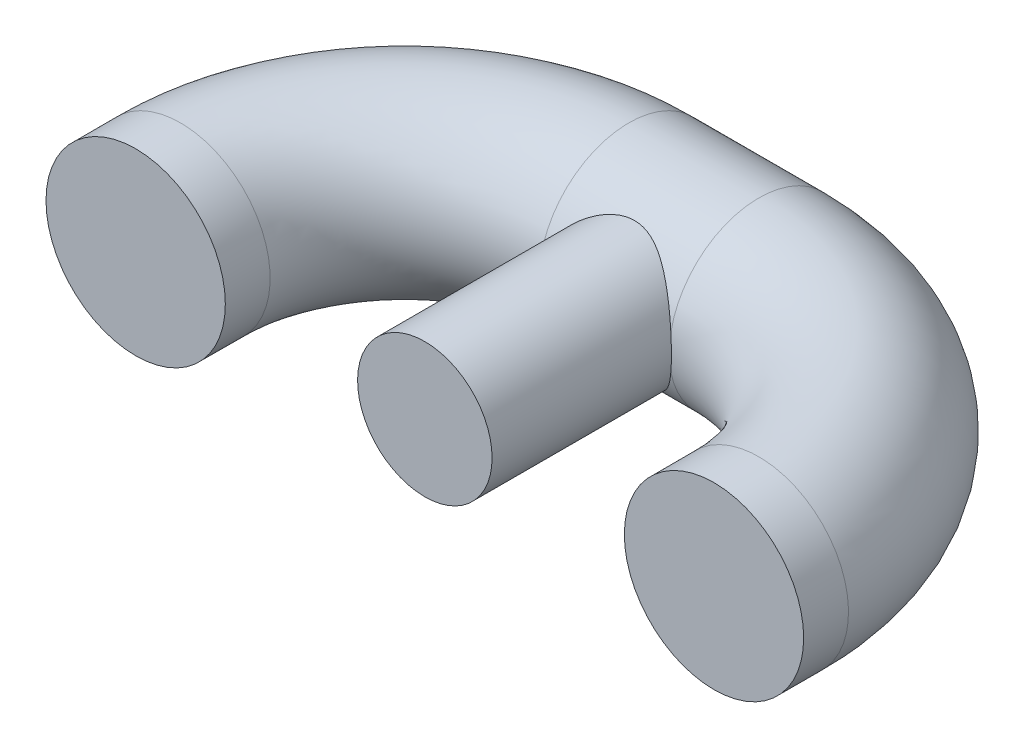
ISO-10303-21;
HEADER;
FILE_DESCRIPTION(('STEP AP214'),'2;1');
FILE_NAME('part.step','',(''),(''),'','','');
FILE_SCHEMA(('AUTOMOTIVE_DESIGN { 1 0 10303 214 1 1 1 1 }'));
ENDSEC;
DATA;
#1=APPLICATION_CONTEXT('core data for automotive mechanical design processes');
#2=APPLICATION_PROTOCOL_DEFINITION('international standard','automotive_design',2000,#1);
#3=PRODUCT_CONTEXT('',#1,'mechanical');
#4=PRODUCT('Part','Part','',(#3));
#5=PRODUCT_RELATED_PRODUCT_CATEGORY('part','',(#4));
#6=PRODUCT_DEFINITION_FORMATION('','',#4);
#7=PRODUCT_DEFINITION_CONTEXT('part definition',#1,'design');
#8=PRODUCT_DEFINITION('design','',#6,#7);
#9=PRODUCT_DEFINITION_SHAPE('','',#8);
#10=(LENGTH_UNIT() NAMED_UNIT(*) SI_UNIT(.MILLI.,.METRE.));
#11=(NAMED_UNIT(*) PLANE_ANGLE_UNIT() SI_UNIT($,.RADIAN.));
#12=(NAMED_UNIT(*) SI_UNIT($,.STERADIAN.) SOLID_ANGLE_UNIT());
#13=UNCERTAINTY_MEASURE_WITH_UNIT(LENGTH_MEASURE(1.E-05),#10,'distance_accuracy_value','');
#14=(GEOMETRIC_REPRESENTATION_CONTEXT(3) GLOBAL_UNCERTAINTY_ASSIGNED_CONTEXT((#13)) GLOBAL_UNIT_ASSIGNED_CONTEXT((#10,
#11,#12)) REPRESENTATION_CONTEXT('',''));
#15=CARTESIAN_POINT('',(0.,0.,0.));
#16=DIRECTION('',(0.,0.,1.));
#17=DIRECTION('',(1.,0.,0.));
#18=AXIS2_PLACEMENT_3D('',#15,#16,#17);
#19=CARTESIAN_POINT('',(0.,0.,0.254));
#20=DIRECTION('',(0.,0.,-1.));
#21=DIRECTION('',(-1.,0.,0.));
#22=AXIS2_PLACEMENT_3D('',#19,#20,#21);
#23=CYLINDRICAL_SURFACE('',#22,0.381);
#24=CARTESIAN_POINT('',(0.,0.,0.254));
#25=DIRECTION('',(0.,0.,1.));
#26=DIRECTION('',(1.,0.,0.));
#27=AXIS2_PLACEMENT_3D('',#24,#25,#26);
#28=CIRCLE('',#27,0.381);
#29=CARTESIAN_POINT('',(0.381,0.,0.254));
#30=VERTEX_POINT('',#29);
#31=EDGE_CURVE('E75',#30,#30,#28,.T.);
#32=ORIENTED_EDGE('',*,*,#31,.F.);
#33=EDGE_LOOP('',(#32));
#34=FACE_BOUND('',#33,.T.);
#35=CARTESIAN_POINT('',(0.368099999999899,0.0983025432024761,-0.771601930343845));
#36=CARTESIAN_POINT('',(0.372626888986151,0.0814541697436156,-0.768241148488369));
#37=CARTESIAN_POINT('',(0.375991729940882,0.0641084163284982,-0.765707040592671));
#38=CARTESIAN_POINT('',(0.380245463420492,0.02943201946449,-0.762481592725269));
#39=CARTESIAN_POINT('',(0.381198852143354,0.01211365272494,-0.761742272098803));
#40=CARTESIAN_POINT('',(0.380753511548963,-0.0207896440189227,-0.762082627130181));
#41=CARTESIAN_POINT('',(0.379573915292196,-0.036379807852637,-0.762992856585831));
#42=CARTESIAN_POINT('',(0.375305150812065,-0.0675522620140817,-0.766227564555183));
#43=CARTESIAN_POINT('',(0.372168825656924,-0.0831245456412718,-0.768586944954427));
#44=CARTESIAN_POINT('',(0.368100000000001,-0.0983025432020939,-0.77160193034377));
#45=B_SPLINE_CURVE_WITH_KNOTS('',3,(#35,#36,#37,#38,#39,#40,#41,#42,#43,#44),.UNSPECIFIED.,.F.,
.F.,(4,2,2,2,4),(0.,0.0532708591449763,0.10510111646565,0.151905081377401,0.199883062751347),.UNSPECIFIED.);
#46=CARTESIAN_POINT('',(0.368300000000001,0.0975505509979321,-0.771454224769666));
#47=VERTEX_POINT('',#46);
#48=CARTESIAN_POINT('',(0.368300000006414,-0.0975505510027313,-0.771454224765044));
#49=VERTEX_POINT('',#48);
#50=EDGE_CURVE('E11',#47,#49,#45,.T.);
#51=ORIENTED_EDGE('',*,*,#50,.F.);
#52=CARTESIAN_POINT('',(-0.381,0.,-0.761999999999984));
#53=CARTESIAN_POINT('',(-0.380997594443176,0.0186030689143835,-0.762002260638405));
#54=CARTESIAN_POINT('',(-0.379626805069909,0.0372278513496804,-0.763032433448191));
#55=CARTESIAN_POINT('',(-0.374226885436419,0.0738964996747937,-0.767062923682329));
#56=CARTESIAN_POINT('',(-0.37019107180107,0.0919387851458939,-0.770068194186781));
#57=CARTESIAN_POINT('',(-0.359736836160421,0.126805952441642,-0.777759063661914));
#58=CARTESIAN_POINT('',(-0.353332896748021,0.143637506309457,-0.782434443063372));
#59=CARTESIAN_POINT('',(-0.338444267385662,0.175875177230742,-0.793113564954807));
#60=CARTESIAN_POINT('',(-0.329960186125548,0.191281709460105,-0.799116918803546));
#61=CARTESIAN_POINT('',(-0.310321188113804,0.221860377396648,-0.812674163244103));
#62=CARTESIAN_POINT('',(-0.298991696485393,0.236878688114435,-0.820320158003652));
#63=CARTESIAN_POINT('',(-0.274448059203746,0.264928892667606,-0.836251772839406));
#64=CARTESIAN_POINT('',(-0.261231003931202,0.277957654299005,-0.844538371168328));
#65=CARTESIAN_POINT('',(-0.230229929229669,0.304386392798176,-0.862911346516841));
#66=CARTESIAN_POINT('',(-0.212063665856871,0.317323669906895,-0.873021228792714));
#67=CARTESIAN_POINT('',(-0.173367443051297,0.340009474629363,-0.892272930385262));
#68=CARTESIAN_POINT('',(-0.152840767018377,0.349762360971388,-0.901416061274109));
#69=CARTESIAN_POINT('',(-0.116966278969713,0.362916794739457,-0.91445802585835));
#70=CARTESIAN_POINT('',(-0.102262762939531,0.367349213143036,-0.919079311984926));
#71=CARTESIAN_POINT('',(-0.072036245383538,0.374448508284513,-0.926664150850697));
#72=CARTESIAN_POINT('',(-0.0565152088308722,0.377119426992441,-0.929631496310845));
#73=CARTESIAN_POINT('',(-0.0248456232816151,0.380524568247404,-0.933440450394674));
#74=CARTESIAN_POINT('',(-0.00869269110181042,0.381241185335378,-0.934262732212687));
#75=CARTESIAN_POINT('',(0.023524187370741,0.380614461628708,-0.933552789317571));
#76=CARTESIAN_POINT('',(0.0395880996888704,0.379270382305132,-0.932019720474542));
#77=CARTESIAN_POINT('',(0.0693906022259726,0.374898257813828,-0.927182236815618));
#78=CARTESIAN_POINT('',(0.0831942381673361,0.372065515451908,-0.924084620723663));
#79=CARTESIAN_POINT('',(0.110093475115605,0.365012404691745,-0.916649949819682));
#80=CARTESIAN_POINT('',(0.123188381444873,0.360790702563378,-0.912311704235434));
#81=CARTESIAN_POINT('',(0.156529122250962,0.348063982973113,-0.899815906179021));
#82=CARTESIAN_POINT('',(0.176123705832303,0.338531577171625,-0.890966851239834));
#83=CARTESIAN_POINT('',(0.213155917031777,0.316529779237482,-0.872405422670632));
#84=CARTESIAN_POINT('',(0.230588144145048,0.304053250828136,-0.862690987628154));
#85=CARTESIAN_POINT('',(0.26358936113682,0.275975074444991,-0.843148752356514));
#86=CARTESIAN_POINT('',(0.279100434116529,0.260302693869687,-0.8333242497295));
#87=CARTESIAN_POINT('',(0.307406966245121,0.226167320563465,-0.814709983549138));
#88=CARTESIAN_POINT('',(0.320207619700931,0.20770978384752,-0.805918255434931));
#89=CARTESIAN_POINT('',(0.340355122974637,0.17218712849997,-0.791769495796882));
#90=CARTESIAN_POINT('',(0.348280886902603,0.155585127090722,-0.786077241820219));
#91=CARTESIAN_POINT('',(0.361753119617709,0.120993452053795,-0.776292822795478));
#92=CARTESIAN_POINT('',(0.367301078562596,0.103004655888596,-0.772199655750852));
#93=CARTESIAN_POINT('',(0.375730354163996,0.065957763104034,-0.765948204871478));
#94=CARTESIAN_POINT('',(0.378595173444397,0.0468938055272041,-0.763801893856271));
#95=CARTESIAN_POINT('',(0.381393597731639,0.00843311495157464,-0.761705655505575));
#96=CARTESIAN_POINT('',(0.381328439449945,-0.0109634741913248,-0.761754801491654));
#97=CARTESIAN_POINT('',(0.378431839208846,-0.0474482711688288,-0.7639239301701));
#98=CARTESIAN_POINT('',(0.375879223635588,-0.064572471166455,-0.765835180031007));
#99=CARTESIAN_POINT('',(0.36856065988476,-0.0980721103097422,-0.771267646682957));
#100=CARTESIAN_POINT('',(0.363794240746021,-0.114447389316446,-0.774789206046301));
#101=CARTESIAN_POINT('',(0.352072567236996,-0.14666386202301,-0.783336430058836));
#102=CARTESIAN_POINT('',(0.345045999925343,-0.16246580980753,-0.78841079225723));
#103=CARTESIAN_POINT('',(0.329140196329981,-0.192663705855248,-0.799675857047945));
#104=CARTESIAN_POINT('',(0.320260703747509,-0.207059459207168,-0.805866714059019));
#105=CARTESIAN_POINT('',(0.299267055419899,-0.236603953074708,-0.820117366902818));
#106=CARTESIAN_POINT('',(0.286860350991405,-0.251476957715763,-0.828316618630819));
#107=CARTESIAN_POINT('',(0.260093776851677,-0.279074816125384,-0.845213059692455));
#108=CARTESIAN_POINT('',(0.245729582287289,-0.291794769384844,-0.853911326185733));
#109=CARTESIAN_POINT('',(0.212305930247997,-0.31718895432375,-0.872822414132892));
#110=CARTESIAN_POINT('',(0.192872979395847,-0.329394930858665,-0.883008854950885));
#111=CARTESIAN_POINT('',(0.151546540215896,-0.350325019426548,-0.90185089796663));
#112=CARTESIAN_POINT('',(0.129660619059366,-0.359059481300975,-0.910511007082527));
#113=CARTESIAN_POINT('',(0.0926047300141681,-0.369863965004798,-0.921718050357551));
#114=CARTESIAN_POINT('',(0.078132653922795,-0.373204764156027,-0.925332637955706));
#115=CARTESIAN_POINT('',(0.048588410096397,-0.378184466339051,-0.930803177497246));
#116=CARTESIAN_POINT('',(0.0335176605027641,-0.379827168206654,-0.932663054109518));
#117=CARTESIAN_POINT('',(0.00309141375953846,-0.381292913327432,-0.934319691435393));
#118=CARTESIAN_POINT('',(-0.0122651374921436,-0.381106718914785,-0.934105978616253));
#119=CARTESIAN_POINT('',(-0.0426864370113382,-0.3789092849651,-0.931630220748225));
#120=CARTESIAN_POINT('',(-0.057750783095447,-0.376895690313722,-0.929365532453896));
#121=CARTESIAN_POINT('',(-0.0904023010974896,-0.370570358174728,-0.922483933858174));
#122=CARTESIAN_POINT('',(-0.107822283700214,-0.365852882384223,-0.917461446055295));
#123=CARTESIAN_POINT('',(-0.141359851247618,-0.354252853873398,-0.905807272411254));
#124=CARTESIAN_POINT('',(-0.157474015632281,-0.347364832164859,-0.899171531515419));
#125=CARTESIAN_POINT('',(-0.193680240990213,-0.328927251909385,-0.88260814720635));
#126=CARTESIAN_POINT('',(-0.213213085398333,-0.316589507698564,-0.872337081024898));
#127=CARTESIAN_POINT('',(-0.249714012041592,-0.288672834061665,-0.851627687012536));
#128=CARTESIAN_POINT('',(-0.266679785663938,-0.273091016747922,-0.841189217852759));
#129=CARTESIAN_POINT('',(-0.297899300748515,-0.23866526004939,-0.821108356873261));
#130=CARTESIAN_POINT('',(-0.312129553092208,-0.219795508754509,-0.81147323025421));
#131=CARTESIAN_POINT('',(-0.337114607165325,-0.179110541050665,-0.794112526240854));
#132=CARTESIAN_POINT('',(-0.347877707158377,-0.157302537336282,-0.786382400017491));
#133=CARTESIAN_POINT('',(-0.362661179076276,-0.118069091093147,-0.775622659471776));
#134=CARTESIAN_POINT('',(-0.367733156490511,-0.101231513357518,-0.771879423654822));
#135=CARTESIAN_POINT('',(-0.375517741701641,-0.0667628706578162,-0.766105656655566));
#136=CARTESIAN_POINT('',(-0.378236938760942,-0.0491341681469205,-0.764070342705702));
#137=CARTESIAN_POINT('',(-0.38056884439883,-0.0209432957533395,-0.76232336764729));
#138=CARTESIAN_POINT('',(-0.38100135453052,-0.0104750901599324,-0.761998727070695));
#139=CARTESIAN_POINT('',(-0.381,0.,-0.761999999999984));
#140=B_SPLINE_CURVE_WITH_KNOTS('',3,(#52,#53,#54,#55,#56,#57,#58,#59,#60,#61,#62,#63,#64,#65,
#66,#67,#68,#69,#70,#71,#72,#73,#74,#75,#76,#77,#78,#79,#80,#81,#82,#83,#84,#85,#86,#87,#88,#89,
#90,#91,#92,#93,#94,#95,#96,#97,#98,#99,#100,#101,#102,#103,#104,#105,#106,#107,#108,#109,#110,
#111,#112,#113,#114,#115,#116,#117,#118,#119,#120,#121,#122,#123,#124,#125,#126,#127,#128,#129,
#130,#131,#132,#133,#134,#135,#136,#137,#138,#139),.UNSPECIFIED.,.T.,.F.,(4,2,2,2,2,2,2,2,2,2,2,
2,2,2,2,2,2,2,2,2,2,2,2,2,2,2,2,2,2,2,2,2,2,2,2,2,2,2,2,2,2,2,2,4),(0.,0.0557712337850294,
0.111682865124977,0.167258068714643,0.222817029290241,0.283520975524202,0.344319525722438,
0.417474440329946,0.490528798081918,0.53847877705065,0.586318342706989,0.63458747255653,
0.682873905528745,0.726000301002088,0.769168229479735,0.839341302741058,0.909686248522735,
0.981801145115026,1.05377656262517,1.11131732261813,1.16882196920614,1.22667790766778,
1.28450942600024,1.33652561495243,1.38855287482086,1.44241631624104,1.49628721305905,
1.55915457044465,1.62216314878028,1.69714823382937,1.77190805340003,1.81759646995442,
1.86318245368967,1.90899880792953,1.95487429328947,2.01076476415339,2.06679720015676,
2.14226710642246,2.21780448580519,2.29396404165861,2.36993993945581,2.42365707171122,
2.47722327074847,2.50862715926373),.UNSPECIFIED.);
#141=CARTESIAN_POINT('',(-0.368299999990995,0.0975505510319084,-0.771454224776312));
#142=VERTEX_POINT('',#141);
#143=EDGE_CURVE('E49',#142,#47,#140,.T.);
#144=ORIENTED_EDGE('',*,*,#143,.F.);
#145=CARTESIAN_POINT('',(-0.368099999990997,-0.0983025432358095,-0.771601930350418));
#146=CARTESIAN_POINT('',(-0.372626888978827,-0.08145416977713,-0.76824114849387));
#147=CARTESIAN_POINT('',(-0.375991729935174,-0.0641084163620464,-0.765707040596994));
#148=CARTESIAN_POINT('',(-0.380245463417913,-0.0294320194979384,-0.762481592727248));
#149=CARTESIAN_POINT('',(-0.381198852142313,-0.012113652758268,-0.761742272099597));
#150=CARTESIAN_POINT('',(-0.38075351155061,0.0207896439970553,-0.762082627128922));
#151=CARTESIAN_POINT('',(-0.379573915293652,0.0363798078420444,-0.762992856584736));
#152=CARTESIAN_POINT('',(-0.375305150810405,0.0675522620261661,-0.766227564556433));
#153=CARTESIAN_POINT('',(-0.372168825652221,0.0831245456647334,-0.768586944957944));
#154=CARTESIAN_POINT('',(-0.368099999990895,0.0983025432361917,-0.771601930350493));
#155=B_SPLINE_CURVE_WITH_KNOTS('',3,(#145,#146,#147,#148,#149,#150,#151,#152,#153,#154),
.UNSPECIFIED.,.F.,.F.,(4,2,2,2,4),(0.,0.053270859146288,0.10510111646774,0.151905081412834,
0.1998830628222),.UNSPECIFIED.);
#156=CARTESIAN_POINT('',(-0.368299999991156,-0.0975505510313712,-0.771454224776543));
#157=VERTEX_POINT('',#156);
#158=EDGE_CURVE('E65',#157,#142,#155,.T.);
#159=ORIENTED_EDGE('',*,*,#158,.F.);
#160=EDGE_CURVE('E59',#49,#157,#140,.T.);
#161=ORIENTED_EDGE('',*,*,#160,.F.);
#162=EDGE_LOOP('',(#51,#144,#159,#161));
#163=FACE_BOUND('',#162,.T.);
#164=ADVANCED_FACE('F37',(#34,#163),#23,.T.);
#165=CARTESIAN_POINT('',(0.,0.,0.254));
#166=DIRECTION('',(0.,0.,1.));
#167=DIRECTION('',(1.,0.,0.));
#168=AXIS2_PLACEMENT_3D('',#165,#166,#167);
#169=PLANE('',#168);
#170=ORIENTED_EDGE('',*,*,#31,.T.);
#171=EDGE_LOOP('',(#170));
#172=FACE_BOUND('',#171,.T.);
#173=ADVANCED_FACE('F124',(#172),#169,.T.);
#174=CARTESIAN_POINT('',(0.3683,0.,0.));
#175=DIRECTION('',(0.,-1.,0.));
#176=DIRECTION('',(1.,0.,0.));
#177=AXIS2_PLACEMENT_3D('',#174,#175,#176);
#178=TOROIDAL_SURFACE('',#177,1.27,0.508);
#179=CARTESIAN_POINT('',(1.6383,0.,0.));
#180=DIRECTION('',(0.,0.,-1.));
#181=DIRECTION('',(-1.,0.,0.));
#182=AXIS2_PLACEMENT_3D('',#179,#180,#181);
#183=CIRCLE('',#182,0.508);
#184=CARTESIAN_POINT('',(1.1303,0.,0.));
#185=VERTEX_POINT('',#184);
#186=EDGE_CURVE('E79',#185,#185,#183,.T.);
#187=ORIENTED_EDGE('',*,*,#186,.T.);
#188=EDGE_LOOP('',(#187));
#189=FACE_BOUND('',#188,.T.);
#190=CARTESIAN_POINT('',(0.368299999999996,0.,-1.27));
#191=DIRECTION('',(-1.,0.,0.));
#192=DIRECTION('',(0.,0.,1.));
#193=AXIS2_PLACEMENT_3D('',#190,#191,#192);
#194=CIRCLE('',#193,0.508);
#195=EDGE_CURVE('E84',#47,#49,#194,.T.);
#196=ORIENTED_EDGE('',*,*,#195,.F.);
#197=ORIENTED_EDGE('',*,*,#50,.T.);
#198=EDGE_LOOP('',(#196,#197));
#199=FACE_BOUND('',#198,.T.);
#200=ADVANCED_FACE('F120',(#189,#199),#178,.T.);
#201=CARTESIAN_POINT('',(-500000.,8.74264690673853E-11,-1.26999999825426));
#202=DIRECTION('',(1.,0.,0.));
#203=DIRECTION('',(0.,0.,-1.));
#204=AXIS2_PLACEMENT_3D('',#201,#202,#203);
#205=CYLINDRICAL_SURFACE('',#204,0.508000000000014);
#206=CARTESIAN_POINT('',(-0.368299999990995,0.,-1.27));
#207=DIRECTION('',(1.,0.,0.));
#208=DIRECTION('',(0.,0.,-1.));
#209=AXIS2_PLACEMENT_3D('',#206,#207,#208);
#210=CIRCLE('',#209,0.508000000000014);
#211=EDGE_CURVE('E73',#157,#142,#210,.T.);
#212=ORIENTED_EDGE('',*,*,#211,.T.);
#213=ORIENTED_EDGE('',*,*,#143,.T.);
#214=ORIENTED_EDGE('',*,*,#195,.T.);
#215=ORIENTED_EDGE('',*,*,#160,.T.);
#216=EDGE_LOOP('',(#212,#213,#214,#215));
#217=FACE_BOUND('',#216,.T.);
#218=ADVANCED_FACE('F77',(#217),#205,.T.);
#219=CARTESIAN_POINT('',(-0.3683,0.,0.));
#220=DIRECTION('',(0.,1.,0.));
#221=DIRECTION('',(-1.,0.,0.));
#222=AXIS2_PLACEMENT_3D('',#219,#220,#221);
#223=TOROIDAL_SURFACE('',#222,1.27,0.508);
#224=CARTESIAN_POINT('',(-1.6383,0.,0.));
#225=DIRECTION('',(0.,0.,-1.));
#226=DIRECTION('',(-1.,0.,0.));
#227=AXIS2_PLACEMENT_3D('',#224,#225,#226);
#228=CIRCLE('',#227,0.508);
#229=CARTESIAN_POINT('',(-2.1463,0.,0.));
#230=VERTEX_POINT('',#229);
#231=EDGE_CURVE('E88',#230,#230,#228,.T.);
#232=ORIENTED_EDGE('',*,*,#231,.T.);
#233=EDGE_LOOP('',(#232));
#234=FACE_BOUND('',#233,.T.);
#235=ORIENTED_EDGE('',*,*,#211,.F.);
#236=ORIENTED_EDGE('',*,*,#158,.T.);
#237=EDGE_LOOP('',(#235,#236));
#238=FACE_BOUND('',#237,.T.);
#239=ADVANCED_FACE('F72',(#234,#238),#223,.T.);
#240=CARTESIAN_POINT('',(1.6383,0.,0.254));
#241=DIRECTION('',(0.,0.,-1.));
#242=DIRECTION('',(-1.,0.,0.));
#243=AXIS2_PLACEMENT_3D('',#240,#241,#242);
#244=CYLINDRICAL_SURFACE('',#243,0.508);
#245=CARTESIAN_POINT('',(1.6383,0.,0.254));
#246=DIRECTION('',(0.,0.,1.));
#247=DIRECTION('',(1.,0.,0.));
#248=AXIS2_PLACEMENT_3D('',#245,#246,#247);
#249=CIRCLE('',#248,0.508);
#250=CARTESIAN_POINT('',(2.1463,0.,0.254));
#251=VERTEX_POINT('',#250);
#252=EDGE_CURVE('E93',#251,#251,#249,.T.);
#253=ORIENTED_EDGE('',*,*,#252,.F.);
#254=EDGE_LOOP('',(#253));
#255=FACE_BOUND('',#254,.T.);
#256=ORIENTED_EDGE('',*,*,#186,.F.);
#257=EDGE_LOOP('',(#256));
#258=FACE_BOUND('',#257,.T.);
#259=ADVANCED_FACE('F108',(#255,#258),#244,.T.);
#260=CARTESIAN_POINT('',(1.6383,0.,0.254));
#261=DIRECTION('',(0.,0.,1.));
#262=DIRECTION('',(1.,0.,0.));
#263=AXIS2_PLACEMENT_3D('',#260,#261,#262);
#264=PLANE('',#263);
#265=ORIENTED_EDGE('',*,*,#252,.T.);
#266=EDGE_LOOP('',(#265));
#267=FACE_BOUND('',#266,.T.);
#268=ADVANCED_FACE('F116',(#267),#264,.T.);
#269=CARTESIAN_POINT('',(-1.6383,0.,0.254));
#270=DIRECTION('',(0.,0.,-1.));
#271=DIRECTION('',(-1.,0.,0.));
#272=AXIS2_PLACEMENT_3D('',#269,#270,#271);
#273=CYLINDRICAL_SURFACE('',#272,0.508);
#274=CARTESIAN_POINT('',(-1.6383,0.,0.254));
#275=DIRECTION('',(0.,0.,1.));
#276=DIRECTION('',(1.,0.,0.));
#277=AXIS2_PLACEMENT_3D('',#274,#275,#276);
#278=CIRCLE('',#277,0.508);
#279=CARTESIAN_POINT('',(-1.1303,0.,0.254));
#280=VERTEX_POINT('',#279);
#281=EDGE_CURVE('E80',#280,#280,#278,.T.);
#282=ORIENTED_EDGE('',*,*,#281,.F.);
#283=EDGE_LOOP('',(#282));
#284=FACE_BOUND('',#283,.T.);
#285=ORIENTED_EDGE('',*,*,#231,.F.);
#286=EDGE_LOOP('',(#285));
#287=FACE_BOUND('',#286,.T.);
#288=ADVANCED_FACE('F113',(#284,#287),#273,.T.);
#289=CARTESIAN_POINT('',(-1.6383,0.,0.254));
#290=DIRECTION('',(0.,0.,1.));
#291=DIRECTION('',(1.,0.,0.));
#292=AXIS2_PLACEMENT_3D('',#289,#290,#291);
#293=PLANE('',#292);
#294=ORIENTED_EDGE('',*,*,#281,.T.);
#295=EDGE_LOOP('',(#294));
#296=FACE_BOUND('',#295,.T.);
#297=ADVANCED_FACE('F110',(#296),#293,.T.);
#298=CLOSED_SHELL('',(#164,#173,#200,#218,#239,#259,#268,#288,#297));
#299=MANIFOLD_SOLID_BREP('B2',#298);
#300=ADVANCED_BREP_SHAPE_REPRESENTATION('',(#18,#299),#14);
#301=SHAPE_DEFINITION_REPRESENTATION(#9,#300);
ENDSEC;
END-ISO-10303-21;
